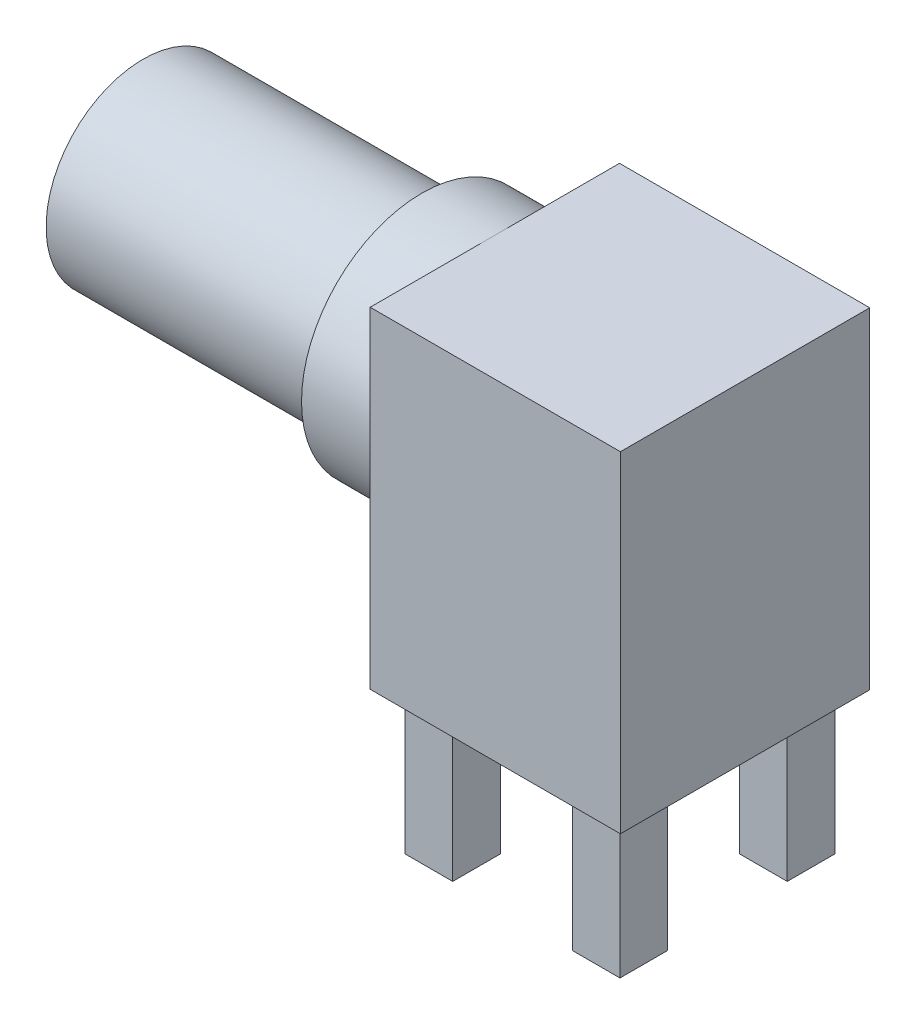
ISO-10303-21;
HEADER;
FILE_DESCRIPTION(('STEP AP214'),'2;1');
FILE_NAME('part.step','',(''),(''),'','','');
FILE_SCHEMA(('AUTOMOTIVE_DESIGN { 1 0 10303 214 1 1 1 1 }'));
ENDSEC;
DATA;
#1=APPLICATION_CONTEXT('core data for automotive mechanical design processes');
#2=APPLICATION_PROTOCOL_DEFINITION('international standard','automotive_design',2000,#1);
#3=PRODUCT_CONTEXT('',#1,'mechanical');
#4=PRODUCT('Part','Part','',(#3));
#5=PRODUCT_RELATED_PRODUCT_CATEGORY('part','',(#4));
#6=PRODUCT_DEFINITION_FORMATION('','',#4);
#7=PRODUCT_DEFINITION_CONTEXT('part definition',#1,'design');
#8=PRODUCT_DEFINITION('design','',#6,#7);
#9=PRODUCT_DEFINITION_SHAPE('','',#8);
#10=(LENGTH_UNIT() NAMED_UNIT(*) SI_UNIT(.MILLI.,.METRE.));
#11=(NAMED_UNIT(*) PLANE_ANGLE_UNIT() SI_UNIT($,.RADIAN.));
#12=(NAMED_UNIT(*) SI_UNIT($,.STERADIAN.) SOLID_ANGLE_UNIT());
#13=UNCERTAINTY_MEASURE_WITH_UNIT(LENGTH_MEASURE(1.E-05),#10,'distance_accuracy_value','');
#14=(GEOMETRIC_REPRESENTATION_CONTEXT(3) GLOBAL_UNCERTAINTY_ASSIGNED_CONTEXT((#13)) GLOBAL_UNIT_ASSIGNED_CONTEXT((#10,
#11,#12)) REPRESENTATION_CONTEXT('',''));
#15=CARTESIAN_POINT('',(0.,0.,0.));
#16=DIRECTION('',(0.,0.,1.));
#17=DIRECTION('',(1.,0.,0.));
#18=AXIS2_PLACEMENT_3D('',#15,#16,#17);
#19=CARTESIAN_POINT('',(-3.50519999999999,-4.63549999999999,3.4925));
#20=DIRECTION('',(0.,1.,0.));
#21=DIRECTION('',(0.,0.,1.));
#22=AXIS2_PLACEMENT_3D('',#19,#20,#21);
#23=PLANE('',#22);
#24=CARTESIAN_POINT('',(0.,-4.63549999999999,0.));
#25=DIRECTION('',(0.,-1.,0.));
#26=DIRECTION('',(0.,0.,-1.));
#27=AXIS2_PLACEMENT_3D('',#24,#25,#26);
#28=CIRCLE('',#27,1.27);
#29=CARTESIAN_POINT('',(0.,-4.63549999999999,-1.27));
#30=VERTEX_POINT('',#29);
#31=EDGE_CURVE('E735',#30,#30,#28,.T.);
#32=ORIENTED_EDGE('',*,*,#31,.F.);
#33=EDGE_LOOP('',(#32));
#34=FACE_BOUND('',#33,.T.);
#35=DIRECTION('',(0.,0.,1.));
#36=VECTOR('',#35,1.);
#37=CARTESIAN_POINT('',(3.0099,-4.63549999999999,-1.6764));
#38=LINE('',#37,#36);
#39=CARTESIAN_POINT('',(3.0099,-4.63549999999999,-3.0099));
#40=VERTEX_POINT('',#39);
#41=CARTESIAN_POINT('',(3.0099,-4.63549999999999,-1.6764));
#42=VERTEX_POINT('',#41);
#43=EDGE_CURVE('E196',#40,#42,#38,.T.);
#44=ORIENTED_EDGE('',*,*,#43,.F.);
#45=DIRECTION('',(1.,0.,0.));
#46=VECTOR('',#45,1.);
#47=CARTESIAN_POINT('',(1.6764,-4.63549999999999,-3.0099));
#48=LINE('',#47,#46);
#49=CARTESIAN_POINT('',(1.6764,-4.63549999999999,-3.0099));
#50=VERTEX_POINT('',#49);
#51=EDGE_CURVE('E209',#50,#40,#48,.T.);
#52=ORIENTED_EDGE('',*,*,#51,.F.);
#53=DIRECTION('',(0.,0.,-1.));
#54=VECTOR('',#53,1.);
#55=CARTESIAN_POINT('',(1.6764,-4.63549999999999,-1.6764));
#56=LINE('',#55,#54);
#57=CARTESIAN_POINT('',(1.6764,-4.63549999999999,-1.6764));
#58=VERTEX_POINT('',#57);
#59=EDGE_CURVE('E218',#58,#50,#56,.T.);
#60=ORIENTED_EDGE('',*,*,#59,.F.);
#61=DIRECTION('',(-1.,0.,0.));
#62=VECTOR('',#61,1.);
#63=CARTESIAN_POINT('',(1.6764,-4.63549999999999,-1.6764));
#64=LINE('',#63,#62);
#65=EDGE_CURVE('E199',#42,#58,#64,.T.);
#66=ORIENTED_EDGE('',*,*,#65,.F.);
#67=EDGE_LOOP('',(#44,#52,#60,#66));
#68=FACE_BOUND('',#67,.T.);
#69=DIRECTION('',(0.,0.,-1.));
#70=VECTOR('',#69,1.);
#71=CARTESIAN_POINT('',(1.6764,-4.63549999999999,1.6764));
#72=LINE('',#71,#70);
#73=CARTESIAN_POINT('',(1.6764,-4.63549999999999,3.0099));
#74=VERTEX_POINT('',#73);
#75=CARTESIAN_POINT('',(1.6764,-4.63549999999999,1.6764));
#76=VERTEX_POINT('',#75);
#77=EDGE_CURVE('E237',#74,#76,#72,.T.);
#78=ORIENTED_EDGE('',*,*,#77,.F.);
#79=DIRECTION('',(-1.,0.,0.));
#80=VECTOR('',#79,1.);
#81=CARTESIAN_POINT('',(3.0099,-4.63549999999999,3.0099));
#82=LINE('',#81,#80);
#83=CARTESIAN_POINT('',(3.0099,-4.63549999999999,3.0099));
#84=VERTEX_POINT('',#83);
#85=EDGE_CURVE('E242',#84,#74,#82,.T.);
#86=ORIENTED_EDGE('',*,*,#85,.F.);
#87=DIRECTION('',(0.,0.,1.));
#88=VECTOR('',#87,1.);
#89=CARTESIAN_POINT('',(3.0099,-4.63549999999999,1.6764));
#90=LINE('',#89,#88);
#91=CARTESIAN_POINT('',(3.0099,-4.63549999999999,1.6764));
#92=VERTEX_POINT('',#91);
#93=EDGE_CURVE('E254',#92,#84,#90,.T.);
#94=ORIENTED_EDGE('',*,*,#93,.F.);
#95=DIRECTION('',(1.,0.,0.));
#96=VECTOR('',#95,1.);
#97=CARTESIAN_POINT('',(3.0099,-4.63549999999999,1.6764));
#98=LINE('',#97,#96);
#99=EDGE_CURVE('E251',#76,#92,#98,.T.);
#100=ORIENTED_EDGE('',*,*,#99,.F.);
#101=EDGE_LOOP('',(#78,#86,#94,#100));
#102=FACE_BOUND('',#101,.T.);
#103=DIRECTION('',(1.,0.,0.));
#104=VECTOR('',#103,1.);
#105=CARTESIAN_POINT('',(-3.50519999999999,-4.63549999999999,-3.4925));
#106=LINE('',#105,#104);
#107=CARTESIAN_POINT('',(-3.50519999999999,-4.63549999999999,-3.4925));
#108=VERTEX_POINT('',#107);
#109=CARTESIAN_POINT('',(3.50520000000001,-4.63549999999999,-3.4925));
#110=VERTEX_POINT('',#109);
#111=EDGE_CURVE('E332',#108,#110,#106,.T.);
#112=ORIENTED_EDGE('',*,*,#111,.T.);
#113=DIRECTION('',(0.,0.,-1.));
#114=VECTOR('',#113,1.);
#115=CARTESIAN_POINT('',(3.50520000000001,-4.63549999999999,3.4925));
#116=LINE('',#115,#114);
#117=CARTESIAN_POINT('',(3.50520000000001,-4.63549999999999,3.4925));
#118=VERTEX_POINT('',#117);
#119=EDGE_CURVE('E338',#118,#110,#116,.T.);
#120=ORIENTED_EDGE('',*,*,#119,.F.);
#121=DIRECTION('',(1.,0.,0.));
#122=VECTOR('',#121,1.);
#123=CARTESIAN_POINT('',(-3.50519999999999,-4.63549999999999,3.4925));
#124=LINE('',#123,#122);
#125=CARTESIAN_POINT('',(-3.50519999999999,-4.63549999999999,3.4925));
#126=VERTEX_POINT('',#125);
#127=EDGE_CURVE('E336',#126,#118,#124,.T.);
#128=ORIENTED_EDGE('',*,*,#127,.F.);
#129=DIRECTION('',(0.,0.,-1.));
#130=VECTOR('',#129,1.);
#131=CARTESIAN_POINT('',(-3.50519999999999,-4.63549999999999,3.4925));
#132=LINE('',#131,#130);
#133=EDGE_CURVE('E349',#126,#108,#132,.T.);
#134=ORIENTED_EDGE('',*,*,#133,.T.);
#135=EDGE_LOOP('',(#112,#120,#128,#134));
#136=FACE_BOUND('',#135,.T.);
#137=DIRECTION('',(0.,0.,1.));
#138=VECTOR('',#137,1.);
#139=CARTESIAN_POINT('',(-1.6764,-4.63549999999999,1.6764));
#140=LINE('',#139,#138);
#141=CARTESIAN_POINT('',(-1.6764,-4.63549999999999,1.6764));
#142=VERTEX_POINT('',#141);
#143=CARTESIAN_POINT('',(-1.6764,-4.63549999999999,3.0099));
#144=VERTEX_POINT('',#143);
#145=EDGE_CURVE('E270',#142,#144,#140,.T.);
#146=ORIENTED_EDGE('',*,*,#145,.F.);
#147=DIRECTION('',(1.,0.,0.));
#148=VECTOR('',#147,1.);
#149=CARTESIAN_POINT('',(-3.0099,-4.63549999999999,1.6764));
#150=LINE('',#149,#148);
#151=CARTESIAN_POINT('',(-3.0099,-4.63549999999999,1.6764));
#152=VERTEX_POINT('',#151);
#153=EDGE_CURVE('E275',#152,#142,#150,.T.);
#154=ORIENTED_EDGE('',*,*,#153,.F.);
#155=DIRECTION('',(0.,0.,-1.));
#156=VECTOR('',#155,1.);
#157=CARTESIAN_POINT('',(-3.0099,-4.63549999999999,1.6764));
#158=LINE('',#157,#156);
#159=CARTESIAN_POINT('',(-3.0099,-4.63549999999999,3.0099));
#160=VERTEX_POINT('',#159);
#161=EDGE_CURVE('E287',#160,#152,#158,.T.);
#162=ORIENTED_EDGE('',*,*,#161,.F.);
#163=DIRECTION('',(-1.,0.,0.));
#164=VECTOR('',#163,1.);
#165=CARTESIAN_POINT('',(-3.0099,-4.63549999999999,3.0099));
#166=LINE('',#165,#164);
#167=EDGE_CURVE('E284',#144,#160,#166,.T.);
#168=ORIENTED_EDGE('',*,*,#167,.F.);
#169=EDGE_LOOP('',(#146,#154,#162,#168));
#170=FACE_BOUND('',#169,.T.);
#171=DIRECTION('',(0.,0.,1.));
#172=VECTOR('',#171,1.);
#173=CARTESIAN_POINT('',(-1.6764,-4.63549999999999,-1.6764));
#174=LINE('',#173,#172);
#175=CARTESIAN_POINT('',(-1.6764,-4.63549999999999,-3.0099));
#176=VERTEX_POINT('',#175);
#177=CARTESIAN_POINT('',(-1.6764,-4.63549999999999,-1.6764));
#178=VERTEX_POINT('',#177);
#179=EDGE_CURVE('E195',#176,#178,#174,.T.);
#180=ORIENTED_EDGE('',*,*,#179,.F.);
#181=DIRECTION('',(1.,0.,0.));
#182=VECTOR('',#181,1.);
#183=CARTESIAN_POINT('',(-3.0099,-4.63549999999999,-3.0099));
#184=LINE('',#183,#182);
#185=CARTESIAN_POINT('',(-3.0099,-4.63549999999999,-3.0099));
#186=VERTEX_POINT('',#185);
#187=EDGE_CURVE('E192',#186,#176,#184,.T.);
#188=ORIENTED_EDGE('',*,*,#187,.F.);
#189=DIRECTION('',(0.,0.,-1.));
#190=VECTOR('',#189,1.);
#191=CARTESIAN_POINT('',(-3.0099,-4.63549999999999,-1.6764));
#192=LINE('',#191,#190);
#193=CARTESIAN_POINT('',(-3.0099,-4.63549999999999,-1.6764));
#194=VERTEX_POINT('',#193);
#195=EDGE_CURVE('E55',#194,#186,#192,.T.);
#196=ORIENTED_EDGE('',*,*,#195,.F.);
#197=DIRECTION('',(-1.,0.,0.));
#198=VECTOR('',#197,1.);
#199=CARTESIAN_POINT('',(-3.0099,-4.63549999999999,-1.6764));
#200=LINE('',#199,#198);
#201=EDGE_CURVE('E50',#178,#194,#200,.T.);
#202=ORIENTED_EDGE('',*,*,#201,.F.);
#203=EDGE_LOOP('',(#180,#188,#196,#202));
#204=FACE_BOUND('',#203,.T.);
#205=ADVANCED_FACE('F35',(#34,#68,#102,#136,#170,#204),#23,.F.);
#206=CARTESIAN_POINT('',(-5.54989999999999,1.26365000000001,0.));
#207=DIRECTION('',(-1.,0.,0.));
#208=DIRECTION('',(0.,0.,1.));
#209=AXIS2_PLACEMENT_3D('',#206,#207,#208);
#210=PLANE('',#209);
#211=CARTESIAN_POINT('',(-5.54989999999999,1.26365000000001,0.));
#212=DIRECTION('',(-1.,0.,0.));
#213=DIRECTION('',(0.,0.,1.));
#214=AXIS2_PLACEMENT_3D('',#211,#212,#213);
#215=CIRCLE('',#214,3.37185);
#216=CARTESIAN_POINT('',(-5.54989999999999,1.26365000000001,3.37185));
#217=VERTEX_POINT('',#216);
#218=EDGE_CURVE('E322',#217,#217,#215,.T.);
#219=ORIENTED_EDGE('',*,*,#218,.T.);
#220=EDGE_LOOP('',(#219));
#221=FACE_BOUND('',#220,.T.);
#222=CARTESIAN_POINT('',(-5.54989999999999,1.26365000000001,0.));
#223=DIRECTION('',(-1.,0.,0.));
#224=DIRECTION('',(0.,0.,1.));
#225=AXIS2_PLACEMENT_3D('',#222,#223,#224);
#226=CIRCLE('',#225,2.7178);
#227=CARTESIAN_POINT('',(-5.54989999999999,1.26365000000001,-2.7178));
#228=VERTEX_POINT('',#227);
#229=EDGE_CURVE('E313',#228,#228,#226,.T.);
#230=ORIENTED_EDGE('',*,*,#229,.F.);
#231=EDGE_LOOP('',(#230));
#232=FACE_BOUND('',#231,.T.);
#233=ADVANCED_FACE('F385',(#221,#232),#210,.T.);
#234=CARTESIAN_POINT('',(-3.50519999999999,-4.63549999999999,3.4925));
#235=DIRECTION('',(1.,0.,0.));
#236=DIRECTION('',(0.,0.,-1.));
#237=AXIS2_PLACEMENT_3D('',#234,#235,#236);
#238=PLANE('',#237);
#239=DIRECTION('',(0.,0.,-1.));
#240=VECTOR('',#239,1.);
#241=CARTESIAN_POINT('',(-3.50519999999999,4.63550000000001,3.4925));
#242=LINE('',#241,#240);
#243=CARTESIAN_POINT('',(-3.50519999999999,4.63550000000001,3.4925));
#244=VERTEX_POINT('',#243);
#245=CARTESIAN_POINT('',(-3.50519999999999,4.63550000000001,0.));
#246=VERTEX_POINT('',#245);
#247=EDGE_CURVE('E43',#244,#246,#242,.T.);
#248=ORIENTED_EDGE('',*,*,#247,.T.);
#249=CARTESIAN_POINT('',(-3.50519999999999,1.26365000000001,0.));
#250=DIRECTION('',(-1.,0.,0.));
#251=DIRECTION('',(0.,0.,1.));
#252=AXIS2_PLACEMENT_3D('',#249,#250,#251);
#253=CIRCLE('',#252,3.37185);
#254=EDGE_CURVE('E319',#246,#246,#253,.T.);
#255=ORIENTED_EDGE('',*,*,#254,.F.);
#256=CARTESIAN_POINT('',(-3.50519999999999,4.63550000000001,-3.4925));
#257=VERTEX_POINT('',#256);
#258=EDGE_CURVE('E351',#246,#257,#242,.T.);
#259=ORIENTED_EDGE('',*,*,#258,.T.);
#260=DIRECTION('',(0.,-1.,0.));
#261=VECTOR('',#260,1.);
#262=CARTESIAN_POINT('',(-3.50519999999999,-4.63549999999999,-3.4925));
#263=LINE('',#262,#261);
#264=EDGE_CURVE('E344',#257,#108,#263,.T.);
#265=ORIENTED_EDGE('',*,*,#264,.T.);
#266=ORIENTED_EDGE('',*,*,#133,.F.);
#267=DIRECTION('',(0.,-1.,0.));
#268=VECTOR('',#267,1.);
#269=CARTESIAN_POINT('',(-3.50519999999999,-4.63549999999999,3.4925));
#270=LINE('',#269,#268);
#271=EDGE_CURVE('E334',#244,#126,#270,.T.);
#272=ORIENTED_EDGE('',*,*,#271,.F.);
#273=EDGE_LOOP('',(#248,#255,#259,#265,#266,#272));
#274=FACE_BOUND('',#273,.T.);
#275=ADVANCED_FACE('F357',(#274),#238,.F.);
#276=CARTESIAN_POINT('',(3.50520000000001,-4.63549999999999,3.4925));
#277=DIRECTION('',(-1.,0.,0.));
#278=DIRECTION('',(0.,0.,1.));
#279=AXIS2_PLACEMENT_3D('',#276,#277,#278);
#280=PLANE('',#279);
#281=DIRECTION('',(0.,1.,0.));
#282=VECTOR('',#281,1.);
#283=CARTESIAN_POINT('',(3.50520000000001,-4.63549999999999,-3.4925));
#284=LINE('',#283,#282);
#285=CARTESIAN_POINT('',(3.50520000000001,4.63550000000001,-3.4925));
#286=VERTEX_POINT('',#285);
#287=EDGE_CURVE('E325',#110,#286,#284,.T.);
#288=ORIENTED_EDGE('',*,*,#287,.T.);
#289=DIRECTION('',(0.,0.,-1.));
#290=VECTOR('',#289,1.);
#291=CARTESIAN_POINT('',(3.50520000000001,4.63550000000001,3.4925));
#292=LINE('',#291,#290);
#293=CARTESIAN_POINT('',(3.50520000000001,4.63550000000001,3.4925));
#294=VERTEX_POINT('',#293);
#295=EDGE_CURVE('E11',#294,#286,#292,.T.);
#296=ORIENTED_EDGE('',*,*,#295,.F.);
#297=DIRECTION('',(0.,1.,0.));
#298=VECTOR('',#297,1.);
#299=CARTESIAN_POINT('',(3.50520000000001,-4.63549999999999,3.4925));
#300=LINE('',#299,#298);
#301=EDGE_CURVE('E328',#118,#294,#300,.T.);
#302=ORIENTED_EDGE('',*,*,#301,.F.);
#303=ORIENTED_EDGE('',*,*,#119,.T.);
#304=EDGE_LOOP('',(#288,#296,#302,#303));
#305=FACE_BOUND('',#304,.T.);
#306=ADVANCED_FACE('F37',(#305),#280,.F.);
#307=CARTESIAN_POINT('',(-3.50519999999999,4.63550000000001,3.4925));
#308=DIRECTION('',(0.,-1.,0.));
#309=DIRECTION('',(0.,0.,-1.));
#310=AXIS2_PLACEMENT_3D('',#307,#308,#309);
#311=PLANE('',#310);
#312=DIRECTION('',(-1.,0.,0.));
#313=VECTOR('',#312,1.);
#314=CARTESIAN_POINT('',(-3.50519999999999,4.63550000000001,-3.4925));
#315=LINE('',#314,#313);
#316=EDGE_CURVE('E341',#286,#257,#315,.T.);
#317=ORIENTED_EDGE('',*,*,#316,.T.);
#318=ORIENTED_EDGE('',*,*,#258,.F.);
#319=ORIENTED_EDGE('',*,*,#247,.F.);
#320=DIRECTION('',(-1.,0.,0.));
#321=VECTOR('',#320,1.);
#322=CARTESIAN_POINT('',(-3.50519999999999,4.63550000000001,3.4925));
#323=LINE('',#322,#321);
#324=EDGE_CURVE('E331',#294,#244,#323,.T.);
#325=ORIENTED_EDGE('',*,*,#324,.F.);
#326=ORIENTED_EDGE('',*,*,#295,.T.);
#327=EDGE_LOOP('',(#317,#318,#319,#325,#326));
#328=FACE_BOUND('',#327,.T.);
#329=ADVANCED_FACE('F361',(#328),#311,.F.);
#330=CARTESIAN_POINT('',(0.,0.,3.4925));
#331=DIRECTION('',(0.,0.,-1.));
#332=DIRECTION('',(-1.,0.,0.));
#333=AXIS2_PLACEMENT_3D('',#330,#331,#332);
#334=PLANE('',#333);
#335=ORIENTED_EDGE('',*,*,#301,.T.);
#336=ORIENTED_EDGE('',*,*,#324,.T.);
#337=ORIENTED_EDGE('',*,*,#271,.T.);
#338=ORIENTED_EDGE('',*,*,#127,.T.);
#339=EDGE_LOOP('',(#335,#336,#337,#338));
#340=FACE_BOUND('',#339,.T.);
#341=ADVANCED_FACE('F374',(#340),#334,.F.);
#342=CARTESIAN_POINT('',(0.,0.,-3.4925));
#343=DIRECTION('',(0.,0.,-1.));
#344=DIRECTION('',(-1.,0.,0.));
#345=AXIS2_PLACEMENT_3D('',#342,#343,#344);
#346=PLANE('',#345);
#347=ORIENTED_EDGE('',*,*,#287,.F.);
#348=ORIENTED_EDGE('',*,*,#111,.F.);
#349=ORIENTED_EDGE('',*,*,#264,.F.);
#350=ORIENTED_EDGE('',*,*,#316,.F.);
#351=EDGE_LOOP('',(#347,#348,#349,#350));
#352=FACE_BOUND('',#351,.T.);
#353=ADVANCED_FACE('F366',(#352),#346,.T.);
#354=CARTESIAN_POINT('',(-5.54989999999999,1.26365000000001,0.));
#355=DIRECTION('',(1.,0.,0.));
#356=DIRECTION('',(0.,0.,-1.));
#357=AXIS2_PLACEMENT_3D('',#354,#355,#356);
#358=CYLINDRICAL_SURFACE('',#357,3.37185);
#359=ORIENTED_EDGE('',*,*,#218,.F.);
#360=EDGE_LOOP('',(#359));
#361=FACE_BOUND('',#360,.T.);
#362=ORIENTED_EDGE('',*,*,#254,.T.);
#363=EDGE_LOOP('',(#362));
#364=FACE_BOUND('',#363,.T.);
#365=ADVANCED_FACE('F381',(#361,#364),#358,.T.);
#366=CARTESIAN_POINT('',(-13.3604,1.26365000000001,0.));
#367=DIRECTION('',(1.,0.,0.));
#368=DIRECTION('',(0.,0.,-1.));
#369=AXIS2_PLACEMENT_3D('',#366,#367,#368);
#370=CYLINDRICAL_SURFACE('',#369,2.7178);
#371=CARTESIAN_POINT('',(-13.3604,1.26365000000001,0.));
#372=DIRECTION('',(-1.,0.,0.));
#373=DIRECTION('',(0.,0.,1.));
#374=AXIS2_PLACEMENT_3D('',#371,#372,#373);
#375=CIRCLE('',#374,2.7178);
#376=CARTESIAN_POINT('',(-13.3604,1.26365000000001,-2.7178));
#377=VERTEX_POINT('',#376);
#378=EDGE_CURVE('E316',#377,#377,#375,.T.);
#379=CARTESIAN_POINT('',(-13.3604,1.26365000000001,-2.7178));
#380=CARTESIAN_POINT('',(-13.279040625,1.26365000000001,-2.7178));
#381=CARTESIAN_POINT('',(-13.19768125,1.26365000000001,-2.7178));
#382=CARTESIAN_POINT('',(-13.0349625,1.26365000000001,-2.7178));
#383=CARTESIAN_POINT('',(-12.953603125,1.26365000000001,-2.7178));
#384=CARTESIAN_POINT('',(-12.790884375,1.26365000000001,-2.7178));
#385=CARTESIAN_POINT('',(-12.709525,1.26365000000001,-2.7178));
#386=CARTESIAN_POINT('',(-12.54680625,1.26365000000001,-2.7178));
#387=CARTESIAN_POINT('',(-12.465446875,1.26365000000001,-2.7178));
#388=CARTESIAN_POINT('',(-12.302728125,1.26365000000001,-2.7178));
#389=CARTESIAN_POINT('',(-12.22136875,1.26365000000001,-2.7178));
#390=CARTESIAN_POINT('',(-12.05865,1.26365000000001,-2.7178));
#391=CARTESIAN_POINT('',(-11.977290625,1.26365000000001,-2.7178));
#392=CARTESIAN_POINT('',(-11.814571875,1.26365000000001,-2.7178));
#393=CARTESIAN_POINT('',(-11.7332125,1.26365000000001,-2.7178));
#394=CARTESIAN_POINT('',(-11.57049375,1.26365000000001,-2.7178));
#395=CARTESIAN_POINT('',(-11.489134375,1.26365000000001,-2.7178));
#396=CARTESIAN_POINT('',(-11.326415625,1.26365000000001,-2.7178));
#397=CARTESIAN_POINT('',(-11.24505625,1.26365000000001,-2.7178));
#398=CARTESIAN_POINT('',(-11.0823375,1.26365000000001,-2.7178));
#399=CARTESIAN_POINT('',(-11.000978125,1.26365000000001,-2.7178));
#400=CARTESIAN_POINT('',(-10.838259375,1.26365000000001,-2.7178));
#401=CARTESIAN_POINT('',(-10.7569,1.26365000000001,-2.7178));
#402=CARTESIAN_POINT('',(-10.59418125,1.26365000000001,-2.7178));
#403=CARTESIAN_POINT('',(-10.512821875,1.26365000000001,-2.7178));
#404=CARTESIAN_POINT('',(-10.350103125,1.26365000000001,-2.7178));
#405=CARTESIAN_POINT('',(-10.26874375,1.26365000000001,-2.7178));
#406=CARTESIAN_POINT('',(-10.106025,1.26365000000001,-2.7178));
#407=CARTESIAN_POINT('',(-10.024665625,1.26365000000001,-2.7178));
#408=CARTESIAN_POINT('',(-9.86194687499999,1.26365000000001,-2.7178));
#409=CARTESIAN_POINT('',(-9.78058749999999,1.26365000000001,-2.7178));
#410=CARTESIAN_POINT('',(-9.61786874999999,1.26365000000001,-2.7178));
#411=CARTESIAN_POINT('',(-9.53650937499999,1.26365000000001,-2.7178));
#412=CARTESIAN_POINT('',(-9.37379062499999,1.26365000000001,-2.7178));
#413=CARTESIAN_POINT('',(-9.29243124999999,1.26365000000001,-2.7178));
#414=CARTESIAN_POINT('',(-9.12971249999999,1.26365000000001,-2.7178));
#415=CARTESIAN_POINT('',(-9.04835312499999,1.26365000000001,-2.7178));
#416=CARTESIAN_POINT('',(-8.885634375,1.26365000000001,-2.7178));
#417=CARTESIAN_POINT('',(-8.80427499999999,1.26365000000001,-2.7178));
#418=CARTESIAN_POINT('',(-8.64155625,1.26365000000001,-2.7178));
#419=CARTESIAN_POINT('',(-8.56019687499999,1.26365000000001,-2.7178));
#420=CARTESIAN_POINT('',(-8.39747812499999,1.26365000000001,-2.7178));
#421=CARTESIAN_POINT('',(-8.31611874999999,1.26365000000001,-2.7178));
#422=CARTESIAN_POINT('',(-8.15339999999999,1.26365000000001,-2.7178));
#423=CARTESIAN_POINT('',(-8.07204062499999,1.26365000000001,-2.7178));
#424=CARTESIAN_POINT('',(-7.90932187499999,1.26365000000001,-2.7178));
#425=CARTESIAN_POINT('',(-7.82796249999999,1.26365000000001,-2.7178));
#426=CARTESIAN_POINT('',(-7.66524374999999,1.26365000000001,-2.7178));
#427=CARTESIAN_POINT('',(-7.58388437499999,1.26365000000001,-2.7178));
#428=CARTESIAN_POINT('',(-7.42116562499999,1.26365000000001,-2.7178));
#429=CARTESIAN_POINT('',(-7.33980624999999,1.26365000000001,-2.7178));
#430=CARTESIAN_POINT('',(-7.17708749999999,1.26365000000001,-2.7178));
#431=CARTESIAN_POINT('',(-7.09572812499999,1.26365000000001,-2.7178));
#432=CARTESIAN_POINT('',(-6.93300937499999,1.26365000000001,-2.7178));
#433=CARTESIAN_POINT('',(-6.85164999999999,1.26365000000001,-2.7178));
#434=CARTESIAN_POINT('',(-6.68893124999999,1.26365000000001,-2.7178));
#435=CARTESIAN_POINT('',(-6.60757187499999,1.26365000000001,-2.7178));
#436=CARTESIAN_POINT('',(-6.44485312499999,1.26365000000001,-2.7178));
#437=CARTESIAN_POINT('',(-6.36349374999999,1.26365000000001,-2.7178));
#438=CARTESIAN_POINT('',(-6.20077499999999,1.26365000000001,-2.7178));
#439=CARTESIAN_POINT('',(-6.11941562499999,1.26365000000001,-2.7178));
#440=CARTESIAN_POINT('',(-5.95669687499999,1.26365000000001,-2.7178));
#441=CARTESIAN_POINT('',(-5.87533749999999,1.26365000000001,-2.7178));
#442=CARTESIAN_POINT('',(-5.71261874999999,1.26365000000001,-2.7178));
#443=CARTESIAN_POINT('',(-5.63125937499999,1.26365000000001,-2.7178));
#444=CARTESIAN_POINT('',(-5.54989999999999,1.26365000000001,-2.7178));
#445=B_SPLINE_CURVE_WITH_KNOTS('',3,(#379,#380,#381,#382,#383,#384,#385,#386,#387,#388,#389,
#390,#391,#392,#393,#394,#395,#396,#397,#398,#399,#400,#401,#402,#403,#404,#405,#406,#407,#408,
#409,#410,#411,#412,#413,#414,#415,#416,#417,#418,#419,#420,#421,#422,#423,#424,#425,#426,#427,
#428,#429,#430,#431,#432,#433,#434,#435,#436,#437,#438,#439,#440,#441,#442,#443,#444),
.UNSPECIFIED.,.F.,.F.,(4,2,2,2,2,2,2,2,2,2,2,2,2,2,2,2,2,2,2,2,2,2,2,2,2,2,2,2,2,2,2,2,4),(0.,
0.244078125,0.48815625,0.732234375,0.9763125,1.220390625,1.46446875,1.708546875,1.952625,
2.196703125,2.44078125,2.684859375,2.9289375,3.173015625,3.41709375,3.661171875,3.90525,
4.149328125,4.39340625,4.637484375,4.8815625,5.125640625,5.36971875,5.613796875,5.857875,
6.101953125,6.34603125,6.590109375,6.8341875,7.078265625,7.32234375,7.566421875,7.8105),.UNSPECIFIED.);
#446=EDGE_CURVE('BSEAM419',#377,#228,#445,.T.);
#447=ORIENTED_EDGE('',*,*,#378,.F.);
#448=ORIENTED_EDGE('',*,*,#229,.T.);
#449=ORIENTED_EDGE('',*,*,#446,.T.);
#450=ORIENTED_EDGE('',*,*,#446,.F.);
#451=EDGE_LOOP('',(#447,#449,#448,#450));
#452=FACE_BOUND('',#451,.T.);
#453=ADVANCED_FACE('F419',(#452),#370,.T.);
#454=CARTESIAN_POINT('',(-13.3604,1.26365000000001,0.));
#455=DIRECTION('',(-1.,0.,0.));
#456=DIRECTION('',(0.,0.,1.));
#457=AXIS2_PLACEMENT_3D('',#454,#455,#456);
#458=PLANE('',#457);
#459=CARTESIAN_POINT('',(-13.3604,1.26365000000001,0.));
#460=DIRECTION('',(-1.,0.,0.));
#461=DIRECTION('',(0.,0.,1.));
#462=AXIS2_PLACEMENT_3D('',#459,#460,#461);
#463=CIRCLE('',#462,2.19252833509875);
#464=CARTESIAN_POINT('',(-13.3604,1.26365000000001,2.19252833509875));
#465=VERTEX_POINT('',#464);
#466=EDGE_CURVE('E307',#465,#465,#463,.T.);
#467=ORIENTED_EDGE('',*,*,#466,.F.);
#468=EDGE_LOOP('',(#467));
#469=FACE_BOUND('',#468,.T.);
#470=ORIENTED_EDGE('',*,*,#378,.T.);
#471=EDGE_LOOP('',(#470));
#472=FACE_BOUND('',#471,.T.);
#473=ADVANCED_FACE('F434',(#469,#472),#458,.T.);
#474=CARTESIAN_POINT('',(-10.1854,1.26365000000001,0.));
#475=DIRECTION('',(-1.,0.,0.));
#476=DIRECTION('',(0.,0.,1.));
#477=AXIS2_PLACEMENT_3D('',#474,#475,#476);
#478=CYLINDRICAL_SURFACE('',#477,2.19252833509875);
#479=CARTESIAN_POINT('',(-10.1854,1.26365000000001,0.));
#480=DIRECTION('',(-1.,0.,0.));
#481=DIRECTION('',(0.,0.,1.));
#482=AXIS2_PLACEMENT_3D('',#479,#480,#481);
#483=CIRCLE('',#482,2.19252833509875);
#484=CARTESIAN_POINT('',(-10.1854,1.26365000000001,2.19252833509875));
#485=VERTEX_POINT('',#484);
#486=EDGE_CURVE('E310',#485,#485,#483,.T.);
#487=ORIENTED_EDGE('',*,*,#486,.F.);
#488=EDGE_LOOP('',(#487));
#489=FACE_BOUND('',#488,.T.);
#490=ORIENTED_EDGE('',*,*,#466,.T.);
#491=EDGE_LOOP('',(#490));
#492=FACE_BOUND('',#491,.T.);
#493=ADVANCED_FACE('F444',(#489,#492),#478,.F.);
#494=CARTESIAN_POINT('',(-10.1854,1.26365000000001,0.));
#495=DIRECTION('',(-1.,0.,0.));
#496=DIRECTION('',(0.,0.,1.));
#497=AXIS2_PLACEMENT_3D('',#494,#495,#496);
#498=PLANE('',#497);
#499=CARTESIAN_POINT('',(-10.1854,1.26365000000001,0.));
#500=DIRECTION('',(-1.,0.,0.));
#501=DIRECTION('',(0.,0.,1.));
#502=AXIS2_PLACEMENT_3D('',#499,#500,#501);
#503=CIRCLE('',#502,0.636954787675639);
#504=CARTESIAN_POINT('',(-10.1854,1.26365000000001,0.63695478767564));
#505=VERTEX_POINT('',#504);
#506=EDGE_CURVE('E304',#505,#505,#503,.T.);
#507=ORIENTED_EDGE('',*,*,#506,.F.);
#508=EDGE_LOOP('',(#507));
#509=FACE_BOUND('',#508,.T.);
#510=ORIENTED_EDGE('',*,*,#486,.T.);
#511=EDGE_LOOP('',(#510));
#512=FACE_BOUND('',#511,.T.);
#513=ADVANCED_FACE('F456',(#509,#512),#498,.T.);
#514=CARTESIAN_POINT('',(-10.1854,1.26365000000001,0.));
#515=DIRECTION('',(-1.,0.,0.));
#516=DIRECTION('',(0.,0.,1.));
#517=AXIS2_PLACEMENT_3D('',#514,#515,#516);
#518=CYLINDRICAL_SURFACE('',#517,0.636954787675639);
#519=ORIENTED_EDGE('',*,*,#506,.T.);
#520=EDGE_LOOP('',(#519));
#521=FACE_BOUND('',#520,.T.);
#522=CARTESIAN_POINT('',(-13.3604,1.26365000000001,0.));
#523=DIRECTION('',(-1.,0.,0.));
#524=DIRECTION('',(0.,0.,1.));
#525=AXIS2_PLACEMENT_3D('',#522,#523,#524);
#526=CIRCLE('',#525,0.636954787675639);
#527=CARTESIAN_POINT('',(-13.3604,1.26365000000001,0.63695478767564));
#528=VERTEX_POINT('',#527);
#529=EDGE_CURVE('E303',#528,#528,#526,.T.);
#530=ORIENTED_EDGE('',*,*,#529,.F.);
#531=EDGE_LOOP('',(#530));
#532=FACE_BOUND('',#531,.T.);
#533=ADVANCED_FACE('F467',(#521,#532),#518,.T.);
#534=ORIENTED_EDGE('',*,*,#529,.T.);
#535=EDGE_LOOP('',(#534));
#536=FACE_BOUND('',#535,.T.);
#537=ADVANCED_FACE('F447',(#536),#458,.T.);
#538=CARTESIAN_POINT('',(-1.6764,-8.62329999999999,1.6764));
#539=DIRECTION('',(-1.,0.,0.));
#540=DIRECTION('',(0.,0.,1.));
#541=AXIS2_PLACEMENT_3D('',#538,#539,#540);
#542=PLANE('',#541);
#543=ORIENTED_EDGE('',*,*,#145,.T.);
#544=DIRECTION('',(0.,1.,0.));
#545=VECTOR('',#544,1.);
#546=CARTESIAN_POINT('',(-1.6764,-8.62329999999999,3.0099));
#547=LINE('',#546,#545);
#548=CARTESIAN_POINT('',(-1.6764,-8.62329999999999,3.0099));
#549=VERTEX_POINT('',#548);
#550=EDGE_CURVE('E300',#549,#144,#547,.T.);
#551=ORIENTED_EDGE('',*,*,#550,.F.);
#552=DIRECTION('',(0.,0.,1.));
#553=VECTOR('',#552,1.);
#554=CARTESIAN_POINT('',(-1.6764,-8.62329999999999,1.6764));
#555=LINE('',#554,#553);
#556=CARTESIAN_POINT('',(-1.6764,-8.62329999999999,1.6764));
#557=VERTEX_POINT('',#556);
#558=EDGE_CURVE('E271',#557,#549,#555,.T.);
#559=ORIENTED_EDGE('',*,*,#558,.F.);
#560=DIRECTION('',(0.,1.,0.));
#561=VECTOR('',#560,1.);
#562=CARTESIAN_POINT('',(-1.6764,-8.62329999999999,1.6764));
#563=LINE('',#562,#561);
#564=EDGE_CURVE('E281',#557,#142,#563,.T.);
#565=ORIENTED_EDGE('',*,*,#564,.T.);
#566=EDGE_LOOP('',(#543,#551,#559,#565));
#567=FACE_BOUND('',#566,.T.);
#568=ADVANCED_FACE('F487',(#567),#542,.F.);
#569=CARTESIAN_POINT('',(-3.0099,-8.62329999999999,3.0099));
#570=DIRECTION('',(0.,0.,-1.));
#571=DIRECTION('',(-1.,0.,0.));
#572=AXIS2_PLACEMENT_3D('',#569,#570,#571);
#573=PLANE('',#572);
#574=ORIENTED_EDGE('',*,*,#167,.T.);
#575=DIRECTION('',(0.,1.,0.));
#576=VECTOR('',#575,1.);
#577=CARTESIAN_POINT('',(-3.0099,-8.62329999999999,3.0099));
#578=LINE('',#577,#576);
#579=CARTESIAN_POINT('',(-3.0099,-8.62329999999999,3.0099));
#580=VERTEX_POINT('',#579);
#581=EDGE_CURVE('E297',#580,#160,#578,.T.);
#582=ORIENTED_EDGE('',*,*,#581,.F.);
#583=DIRECTION('',(-1.,0.,0.));
#584=VECTOR('',#583,1.);
#585=CARTESIAN_POINT('',(-3.0099,-8.62329999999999,3.0099));
#586=LINE('',#585,#584);
#587=EDGE_CURVE('E274',#549,#580,#586,.T.);
#588=ORIENTED_EDGE('',*,*,#587,.F.);
#589=ORIENTED_EDGE('',*,*,#550,.T.);
#590=EDGE_LOOP('',(#574,#582,#588,#589));
#591=FACE_BOUND('',#590,.T.);
#592=ADVANCED_FACE('F496',(#591),#573,.F.);
#593=CARTESIAN_POINT('',(-3.0099,-8.62329999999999,1.6764));
#594=DIRECTION('',(1.,0.,0.));
#595=DIRECTION('',(0.,0.,-1.));
#596=AXIS2_PLACEMENT_3D('',#593,#594,#595);
#597=PLANE('',#596);
#598=ORIENTED_EDGE('',*,*,#161,.T.);
#599=DIRECTION('',(0.,1.,0.));
#600=VECTOR('',#599,1.);
#601=CARTESIAN_POINT('',(-3.0099,-8.62329999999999,1.6764));
#602=LINE('',#601,#600);
#603=CARTESIAN_POINT('',(-3.0099,-8.62329999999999,1.6764));
#604=VERTEX_POINT('',#603);
#605=EDGE_CURVE('E294',#604,#152,#602,.T.);
#606=ORIENTED_EDGE('',*,*,#605,.F.);
#607=DIRECTION('',(0.,0.,-1.));
#608=VECTOR('',#607,1.);
#609=CARTESIAN_POINT('',(-3.0099,-8.62329999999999,1.6764));
#610=LINE('',#609,#608);
#611=EDGE_CURVE('E277',#580,#604,#610,.T.);
#612=ORIENTED_EDGE('',*,*,#611,.F.);
#613=ORIENTED_EDGE('',*,*,#581,.T.);
#614=EDGE_LOOP('',(#598,#606,#612,#613));
#615=FACE_BOUND('',#614,.T.);
#616=ADVANCED_FACE('F506',(#615),#597,.F.);
#617=CARTESIAN_POINT('',(-3.0099,-8.62329999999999,1.6764));
#618=DIRECTION('',(0.,0.,1.));
#619=DIRECTION('',(1.,0.,0.));
#620=AXIS2_PLACEMENT_3D('',#617,#618,#619);
#621=PLANE('',#620);
#622=ORIENTED_EDGE('',*,*,#153,.T.);
#623=ORIENTED_EDGE('',*,*,#564,.F.);
#624=DIRECTION('',(1.,0.,0.));
#625=VECTOR('',#624,1.);
#626=CARTESIAN_POINT('',(-3.0099,-8.62329999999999,1.6764));
#627=LINE('',#626,#625);
#628=EDGE_CURVE('E279',#604,#557,#627,.T.);
#629=ORIENTED_EDGE('',*,*,#628,.F.);
#630=ORIENTED_EDGE('',*,*,#605,.T.);
#631=EDGE_LOOP('',(#622,#623,#629,#630));
#632=FACE_BOUND('',#631,.T.);
#633=ADVANCED_FACE('F516',(#632),#621,.F.);
#634=CARTESIAN_POINT('',(0.,-8.62329999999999,0.));
#635=DIRECTION('',(0.,1.,0.));
#636=DIRECTION('',(0.,0.,1.));
#637=AXIS2_PLACEMENT_3D('',#634,#635,#636);
#638=PLANE('',#637);
#639=ORIENTED_EDGE('',*,*,#558,.T.);
#640=ORIENTED_EDGE('',*,*,#587,.T.);
#641=ORIENTED_EDGE('',*,*,#611,.T.);
#642=ORIENTED_EDGE('',*,*,#628,.T.);
#643=EDGE_LOOP('',(#639,#640,#641,#642));
#644=FACE_BOUND('',#643,.T.);
#645=ADVANCED_FACE('F526',(#644),#638,.F.);
#646=CARTESIAN_POINT('',(1.6764,-8.62329999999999,1.6764));
#647=DIRECTION('',(1.,0.,0.));
#648=DIRECTION('',(0.,0.,-1.));
#649=AXIS2_PLACEMENT_3D('',#646,#647,#648);
#650=PLANE('',#649);
#651=ORIENTED_EDGE('',*,*,#77,.T.);
#652=DIRECTION('',(0.,1.,0.));
#653=VECTOR('',#652,1.);
#654=CARTESIAN_POINT('',(1.6764,-8.62329999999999,1.6764));
#655=LINE('',#654,#653);
#656=CARTESIAN_POINT('',(1.6764,-8.62329999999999,1.6764));
#657=VERTEX_POINT('',#656);
#658=EDGE_CURVE('E267',#657,#76,#655,.T.);
#659=ORIENTED_EDGE('',*,*,#658,.F.);
#660=DIRECTION('',(0.,0.,-1.));
#661=VECTOR('',#660,1.);
#662=CARTESIAN_POINT('',(1.6764,-8.62329999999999,1.6764));
#663=LINE('',#662,#661);
#664=CARTESIAN_POINT('',(1.6764,-8.62329999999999,3.0099));
#665=VERTEX_POINT('',#664);
#666=EDGE_CURVE('E238',#665,#657,#663,.T.);
#667=ORIENTED_EDGE('',*,*,#666,.F.);
#668=DIRECTION('',(0.,1.,0.));
#669=VECTOR('',#668,1.);
#670=CARTESIAN_POINT('',(1.6764,-8.62329999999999,3.0099));
#671=LINE('',#670,#669);
#672=EDGE_CURVE('E248',#665,#74,#671,.T.);
#673=ORIENTED_EDGE('',*,*,#672,.T.);
#674=EDGE_LOOP('',(#651,#659,#667,#673));
#675=FACE_BOUND('',#674,.T.);
#676=ADVANCED_FACE('F536',(#675),#650,.F.);
#677=CARTESIAN_POINT('',(3.0099,-8.62329999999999,1.6764));
#678=DIRECTION('',(0.,0.,1.));
#679=DIRECTION('',(1.,0.,0.));
#680=AXIS2_PLACEMENT_3D('',#677,#678,#679);
#681=PLANE('',#680);
#682=ORIENTED_EDGE('',*,*,#99,.T.);
#683=DIRECTION('',(0.,1.,0.));
#684=VECTOR('',#683,1.);
#685=CARTESIAN_POINT('',(3.0099,-8.62329999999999,1.6764));
#686=LINE('',#685,#684);
#687=CARTESIAN_POINT('',(3.0099,-8.62329999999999,1.6764));
#688=VERTEX_POINT('',#687);
#689=EDGE_CURVE('E264',#688,#92,#686,.T.);
#690=ORIENTED_EDGE('',*,*,#689,.F.);
#691=DIRECTION('',(1.,0.,0.));
#692=VECTOR('',#691,1.);
#693=CARTESIAN_POINT('',(3.0099,-8.62329999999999,1.6764));
#694=LINE('',#693,#692);
#695=EDGE_CURVE('E241',#657,#688,#694,.T.);
#696=ORIENTED_EDGE('',*,*,#695,.F.);
#697=ORIENTED_EDGE('',*,*,#658,.T.);
#698=EDGE_LOOP('',(#682,#690,#696,#697));
#699=FACE_BOUND('',#698,.T.);
#700=ADVANCED_FACE('F546',(#699),#681,.F.);
#701=CARTESIAN_POINT('',(3.0099,-8.62329999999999,1.6764));
#702=DIRECTION('',(-1.,0.,0.));
#703=DIRECTION('',(0.,0.,1.));
#704=AXIS2_PLACEMENT_3D('',#701,#702,#703);
#705=PLANE('',#704);
#706=ORIENTED_EDGE('',*,*,#93,.T.);
#707=DIRECTION('',(0.,1.,0.));
#708=VECTOR('',#707,1.);
#709=CARTESIAN_POINT('',(3.0099,-8.62329999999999,3.0099));
#710=LINE('',#709,#708);
#711=CARTESIAN_POINT('',(3.0099,-8.62329999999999,3.0099));
#712=VERTEX_POINT('',#711);
#713=EDGE_CURVE('E261',#712,#84,#710,.T.);
#714=ORIENTED_EDGE('',*,*,#713,.F.);
#715=DIRECTION('',(0.,0.,1.));
#716=VECTOR('',#715,1.);
#717=CARTESIAN_POINT('',(3.0099,-8.62329999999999,1.6764));
#718=LINE('',#717,#716);
#719=EDGE_CURVE('E244',#688,#712,#718,.T.);
#720=ORIENTED_EDGE('',*,*,#719,.F.);
#721=ORIENTED_EDGE('',*,*,#689,.T.);
#722=EDGE_LOOP('',(#706,#714,#720,#721));
#723=FACE_BOUND('',#722,.T.);
#724=ADVANCED_FACE('F556',(#723),#705,.F.);
#725=CARTESIAN_POINT('',(3.0099,-8.62329999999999,3.0099));
#726=DIRECTION('',(0.,0.,-1.));
#727=DIRECTION('',(-1.,0.,0.));
#728=AXIS2_PLACEMENT_3D('',#725,#726,#727);
#729=PLANE('',#728);
#730=ORIENTED_EDGE('',*,*,#85,.T.);
#731=ORIENTED_EDGE('',*,*,#672,.F.);
#732=DIRECTION('',(-1.,0.,0.));
#733=VECTOR('',#732,1.);
#734=CARTESIAN_POINT('',(3.0099,-8.62329999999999,3.0099));
#735=LINE('',#734,#733);
#736=EDGE_CURVE('E246',#712,#665,#735,.T.);
#737=ORIENTED_EDGE('',*,*,#736,.F.);
#738=ORIENTED_EDGE('',*,*,#713,.T.);
#739=EDGE_LOOP('',(#730,#731,#737,#738));
#740=FACE_BOUND('',#739,.T.);
#741=ADVANCED_FACE('F566',(#740),#729,.F.);
#742=CARTESIAN_POINT('',(0.,-8.62329999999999,0.));
#743=DIRECTION('',(0.,-1.,0.));
#744=DIRECTION('',(0.,0.,-1.));
#745=AXIS2_PLACEMENT_3D('',#742,#743,#744);
#746=PLANE('',#745);
#747=ORIENTED_EDGE('',*,*,#666,.T.);
#748=ORIENTED_EDGE('',*,*,#695,.T.);
#749=ORIENTED_EDGE('',*,*,#719,.T.);
#750=ORIENTED_EDGE('',*,*,#736,.T.);
#751=EDGE_LOOP('',(#747,#748,#749,#750));
#752=FACE_BOUND('',#751,.T.);
#753=ADVANCED_FACE('F576',(#752),#746,.T.);
#754=CARTESIAN_POINT('',(3.0099,-8.62329999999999,-1.6764));
#755=DIRECTION('',(-1.,0.,0.));
#756=DIRECTION('',(0.,0.,1.));
#757=AXIS2_PLACEMENT_3D('',#754,#755,#756);
#758=PLANE('',#757);
#759=ORIENTED_EDGE('',*,*,#43,.T.);
#760=DIRECTION('',(0.,1.,0.));
#761=VECTOR('',#760,1.);
#762=CARTESIAN_POINT('',(3.0099,-8.62329999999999,-1.6764));
#763=LINE('',#762,#761);
#764=CARTESIAN_POINT('',(3.0099,-8.62329999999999,-1.6764));
#765=VERTEX_POINT('',#764);
#766=EDGE_CURVE('E231',#765,#42,#763,.T.);
#767=ORIENTED_EDGE('',*,*,#766,.F.);
#768=DIRECTION('',(0.,0.,1.));
#769=VECTOR('',#768,1.);
#770=CARTESIAN_POINT('',(3.0099,-8.62329999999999,-1.6764));
#771=LINE('',#770,#769);
#772=CARTESIAN_POINT('',(3.0099,-8.62329999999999,-3.0099));
#773=VERTEX_POINT('',#772);
#774=EDGE_CURVE('E205',#773,#765,#771,.T.);
#775=ORIENTED_EDGE('',*,*,#774,.F.);
#776=DIRECTION('',(0.,1.,0.));
#777=VECTOR('',#776,1.);
#778=CARTESIAN_POINT('',(3.0099,-8.62329999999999,-3.0099));
#779=LINE('',#778,#777);
#780=EDGE_CURVE('E214',#773,#40,#779,.T.);
#781=ORIENTED_EDGE('',*,*,#780,.T.);
#782=EDGE_LOOP('',(#759,#767,#775,#781));
#783=FACE_BOUND('',#782,.T.);
#784=ADVANCED_FACE('F586',(#783),#758,.F.);
#785=CARTESIAN_POINT('',(1.6764,-8.62329999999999,-1.6764));
#786=DIRECTION('',(0.,0.,-1.));
#787=DIRECTION('',(-1.,0.,0.));
#788=AXIS2_PLACEMENT_3D('',#785,#786,#787);
#789=PLANE('',#788);
#790=ORIENTED_EDGE('',*,*,#65,.T.);
#791=DIRECTION('',(0.,1.,0.));
#792=VECTOR('',#791,1.);
#793=CARTESIAN_POINT('',(1.6764,-8.62329999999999,-1.6764));
#794=LINE('',#793,#792);
#795=CARTESIAN_POINT('',(1.6764,-8.62329999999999,-1.6764));
#796=VERTEX_POINT('',#795);
#797=EDGE_CURVE('E228',#796,#58,#794,.T.);
#798=ORIENTED_EDGE('',*,*,#797,.F.);
#799=DIRECTION('',(-1.,0.,0.));
#800=VECTOR('',#799,1.);
#801=CARTESIAN_POINT('',(1.6764,-8.62329999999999,-1.6764));
#802=LINE('',#801,#800);
#803=EDGE_CURVE('E208',#765,#796,#802,.T.);
#804=ORIENTED_EDGE('',*,*,#803,.F.);
#805=ORIENTED_EDGE('',*,*,#766,.T.);
#806=EDGE_LOOP('',(#790,#798,#804,#805));
#807=FACE_BOUND('',#806,.T.);
#808=ADVANCED_FACE('F611',(#807),#789,.F.);
#809=CARTESIAN_POINT('',(1.6764,-8.62329999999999,-1.6764));
#810=DIRECTION('',(1.,0.,0.));
#811=DIRECTION('',(0.,0.,-1.));
#812=AXIS2_PLACEMENT_3D('',#809,#810,#811);
#813=PLANE('',#812);
#814=ORIENTED_EDGE('',*,*,#59,.T.);
#815=DIRECTION('',(0.,1.,0.));
#816=VECTOR('',#815,1.);
#817=CARTESIAN_POINT('',(1.6764,-8.62329999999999,-3.0099));
#818=LINE('',#817,#816);
#819=CARTESIAN_POINT('',(1.6764,-8.62329999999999,-3.0099));
#820=VERTEX_POINT('',#819);
#821=EDGE_CURVE('E225',#820,#50,#818,.T.);
#822=ORIENTED_EDGE('',*,*,#821,.F.);
#823=DIRECTION('',(0.,0.,-1.));
#824=VECTOR('',#823,1.);
#825=CARTESIAN_POINT('',(1.6764,-8.62329999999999,-1.6764));
#826=LINE('',#825,#824);
#827=EDGE_CURVE('E211',#796,#820,#826,.T.);
#828=ORIENTED_EDGE('',*,*,#827,.F.);
#829=ORIENTED_EDGE('',*,*,#797,.T.);
#830=EDGE_LOOP('',(#814,#822,#828,#829));
#831=FACE_BOUND('',#830,.T.);
#832=ADVANCED_FACE('F621',(#831),#813,.F.);
#833=CARTESIAN_POINT('',(1.6764,-8.62329999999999,-3.0099));
#834=DIRECTION('',(0.,0.,1.));
#835=DIRECTION('',(1.,0.,0.));
#836=AXIS2_PLACEMENT_3D('',#833,#834,#835);
#837=PLANE('',#836);
#838=ORIENTED_EDGE('',*,*,#51,.T.);
#839=ORIENTED_EDGE('',*,*,#780,.F.);
#840=DIRECTION('',(1.,0.,0.));
#841=VECTOR('',#840,1.);
#842=CARTESIAN_POINT('',(1.6764,-8.62329999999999,-3.0099));
#843=LINE('',#842,#841);
#844=EDGE_CURVE('E213',#820,#773,#843,.T.);
#845=ORIENTED_EDGE('',*,*,#844,.F.);
#846=ORIENTED_EDGE('',*,*,#821,.T.);
#847=EDGE_LOOP('',(#838,#839,#845,#846));
#848=FACE_BOUND('',#847,.T.);
#849=ADVANCED_FACE('F631',(#848),#837,.F.);
#850=CARTESIAN_POINT('',(0.,-8.62329999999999,0.));
#851=DIRECTION('',(0.,-1.,0.));
#852=DIRECTION('',(0.,0.,-1.));
#853=AXIS2_PLACEMENT_3D('',#850,#851,#852);
#854=PLANE('',#853);
#855=ORIENTED_EDGE('',*,*,#774,.T.);
#856=ORIENTED_EDGE('',*,*,#803,.T.);
#857=ORIENTED_EDGE('',*,*,#827,.T.);
#858=ORIENTED_EDGE('',*,*,#844,.T.);
#859=EDGE_LOOP('',(#855,#856,#857,#858));
#860=FACE_BOUND('',#859,.T.);
#861=ADVANCED_FACE('F641',(#860),#854,.T.);
#862=CARTESIAN_POINT('',(-1.6764,-8.62329999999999,-1.6764));
#863=DIRECTION('',(-1.,0.,0.));
#864=DIRECTION('',(0.,0.,1.));
#865=AXIS2_PLACEMENT_3D('',#862,#863,#864);
#866=PLANE('',#865);
#867=ORIENTED_EDGE('',*,*,#179,.T.);
#868=DIRECTION('',(0.,1.,0.));
#869=VECTOR('',#868,1.);
#870=CARTESIAN_POINT('',(-1.6764,-8.62329999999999,-1.6764));
#871=LINE('',#870,#869);
#872=CARTESIAN_POINT('',(-1.6764,-8.62329999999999,-1.6764));
#873=VERTEX_POINT('',#872);
#874=EDGE_CURVE('E176',#873,#178,#871,.T.);
#875=ORIENTED_EDGE('',*,*,#874,.F.);
#876=DIRECTION('',(0.,0.,1.));
#877=VECTOR('',#876,1.);
#878=CARTESIAN_POINT('',(-1.6764,-8.62329999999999,-1.6764));
#879=LINE('',#878,#877);
#880=CARTESIAN_POINT('',(-1.6764,-8.62329999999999,-3.0099));
#881=VERTEX_POINT('',#880);
#882=EDGE_CURVE('E183',#881,#873,#879,.T.);
#883=ORIENTED_EDGE('',*,*,#882,.F.);
#884=DIRECTION('',(0.,1.,0.));
#885=VECTOR('',#884,1.);
#886=CARTESIAN_POINT('',(-1.6764,-8.62329999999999,-3.0099));
#887=LINE('',#886,#885);
#888=EDGE_CURVE('E745',#881,#176,#887,.T.);
#889=ORIENTED_EDGE('',*,*,#888,.T.);
#890=EDGE_LOOP('',(#867,#875,#883,#889));
#891=FACE_BOUND('',#890,.T.);
#892=ADVANCED_FACE('F194',(#891),#866,.F.);
#893=CARTESIAN_POINT('',(-3.0099,-8.62329999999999,-1.6764));
#894=DIRECTION('',(0.,0.,-1.));
#895=DIRECTION('',(-1.,0.,0.));
#896=AXIS2_PLACEMENT_3D('',#893,#894,#895);
#897=PLANE('',#896);
#898=ORIENTED_EDGE('',*,*,#201,.T.);
#899=DIRECTION('',(0.,1.,0.));
#900=VECTOR('',#899,1.);
#901=CARTESIAN_POINT('',(-3.0099,-8.62329999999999,-1.6764));
#902=LINE('',#901,#900);
#903=CARTESIAN_POINT('',(-3.0099,-8.62329999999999,-1.6764));
#904=VERTEX_POINT('',#903);
#905=EDGE_CURVE('E179',#904,#194,#902,.T.);
#906=ORIENTED_EDGE('',*,*,#905,.F.);
#907=DIRECTION('',(-1.,0.,0.));
#908=VECTOR('',#907,1.);
#909=CARTESIAN_POINT('',(-3.0099,-8.62329999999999,-1.6764));
#910=LINE('',#909,#908);
#911=EDGE_CURVE('E172',#873,#904,#910,.T.);
#912=ORIENTED_EDGE('',*,*,#911,.F.);
#913=ORIENTED_EDGE('',*,*,#874,.T.);
#914=EDGE_LOOP('',(#898,#906,#912,#913));
#915=FACE_BOUND('',#914,.T.);
#916=ADVANCED_FACE('F174',(#915),#897,.F.);
#917=CARTESIAN_POINT('',(-3.0099,-8.62329999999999,-1.6764));
#918=DIRECTION('',(1.,0.,0.));
#919=DIRECTION('',(0.,0.,-1.));
#920=AXIS2_PLACEMENT_3D('',#917,#918,#919);
#921=PLANE('',#920);
#922=ORIENTED_EDGE('',*,*,#195,.T.);
#923=DIRECTION('',(0.,1.,0.));
#924=VECTOR('',#923,1.);
#925=CARTESIAN_POINT('',(-3.0099,-8.62329999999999,-3.0099));
#926=LINE('',#925,#924);
#927=CARTESIAN_POINT('',(-3.0099,-8.62329999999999,-3.0099));
#928=VERTEX_POINT('',#927);
#929=EDGE_CURVE('E201',#928,#186,#926,.T.);
#930=ORIENTED_EDGE('',*,*,#929,.F.);
#931=DIRECTION('',(0.,0.,-1.));
#932=VECTOR('',#931,1.);
#933=CARTESIAN_POINT('',(-3.0099,-8.62329999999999,-1.6764));
#934=LINE('',#933,#932);
#935=EDGE_CURVE('E182',#904,#928,#934,.T.);
#936=ORIENTED_EDGE('',*,*,#935,.F.);
#937=ORIENTED_EDGE('',*,*,#905,.T.);
#938=EDGE_LOOP('',(#922,#930,#936,#937));
#939=FACE_BOUND('',#938,.T.);
#940=ADVANCED_FACE('F668',(#939),#921,.F.);
#941=CARTESIAN_POINT('',(-3.0099,-8.62329999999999,-3.0099));
#942=DIRECTION('',(0.,0.,1.));
#943=DIRECTION('',(1.,0.,0.));
#944=AXIS2_PLACEMENT_3D('',#941,#942,#943);
#945=PLANE('',#944);
#946=ORIENTED_EDGE('',*,*,#187,.T.);
#947=ORIENTED_EDGE('',*,*,#888,.F.);
#948=DIRECTION('',(1.,0.,0.));
#949=VECTOR('',#948,1.);
#950=CARTESIAN_POINT('',(-3.0099,-8.62329999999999,-3.0099));
#951=LINE('',#950,#949);
#952=EDGE_CURVE('E188',#928,#881,#951,.T.);
#953=ORIENTED_EDGE('',*,*,#952,.F.);
#954=ORIENTED_EDGE('',*,*,#929,.T.);
#955=EDGE_LOOP('',(#946,#947,#953,#954));
#956=FACE_BOUND('',#955,.T.);
#957=ADVANCED_FACE('F677',(#956),#945,.F.);
#958=CARTESIAN_POINT('',(0.,-8.62329999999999,0.));
#959=DIRECTION('',(0.,-1.,0.));
#960=DIRECTION('',(0.,0.,-1.));
#961=AXIS2_PLACEMENT_3D('',#958,#959,#960);
#962=PLANE('',#961);
#963=ORIENTED_EDGE('',*,*,#882,.T.);
#964=ORIENTED_EDGE('',*,*,#911,.T.);
#965=ORIENTED_EDGE('',*,*,#935,.T.);
#966=ORIENTED_EDGE('',*,*,#952,.T.);
#967=EDGE_LOOP('',(#963,#964,#965,#966));
#968=FACE_BOUND('',#967,.T.);
#969=ADVANCED_FACE('F186',(#968),#962,.T.);
#970=CARTESIAN_POINT('',(0.,-4.50849999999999,0.));
#971=DIRECTION('',(0.,-1.,0.));
#972=DIRECTION('',(0.,0.,-1.));
#973=AXIS2_PLACEMENT_3D('',#970,#971,#972);
#974=CYLINDRICAL_SURFACE('',#973,1.27);
#975=CARTESIAN_POINT('',(0.,-4.50849999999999,0.));
#976=DIRECTION('',(0.,-1.,0.));
#977=DIRECTION('',(0.,0.,-1.));
#978=AXIS2_PLACEMENT_3D('',#975,#976,#977);
#979=CIRCLE('',#978,1.27);
#980=CARTESIAN_POINT('',(0.,-4.50849999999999,-1.27));
#981=VERTEX_POINT('',#980);
#982=EDGE_CURVE('E738',#981,#981,#979,.T.);
#983=ORIENTED_EDGE('',*,*,#982,.F.);
#984=EDGE_LOOP('',(#983));
#985=FACE_BOUND('',#984,.T.);
#986=ORIENTED_EDGE('',*,*,#31,.T.);
#987=EDGE_LOOP('',(#986));
#988=FACE_BOUND('',#987,.T.);
#989=ADVANCED_FACE('F695',(#985,#988),#974,.F.);
#990=CARTESIAN_POINT('',(0.,-4.50849999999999,0.));
#991=DIRECTION('',(0.,-1.,0.));
#992=DIRECTION('',(0.,0.,-1.));
#993=AXIS2_PLACEMENT_3D('',#990,#991,#992);
#994=PLANE('',#993);
#995=CARTESIAN_POINT('',(0.,-4.50849999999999,0.));
#996=DIRECTION('',(0.,-1.,0.));
#997=DIRECTION('',(0.,0.,-1.));
#998=AXIS2_PLACEMENT_3D('',#995,#996,#997);
#999=CIRCLE('',#998,0.7874);
#1000=CARTESIAN_POINT('',(0.,-4.50849999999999,-0.787400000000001));
#1001=VERTEX_POINT('',#1000);
#1002=EDGE_CURVE('E734',#1001,#1001,#999,.T.);
#1003=ORIENTED_EDGE('',*,*,#1002,.F.);
#1004=EDGE_LOOP('',(#1003));
#1005=FACE_BOUND('',#1004,.T.);
#1006=ORIENTED_EDGE('',*,*,#982,.T.);
#1007=EDGE_LOOP('',(#1006));
#1008=FACE_BOUND('',#1007,.T.);
#1009=ADVANCED_FACE('F600',(#1005,#1008),#994,.T.);
#1010=CARTESIAN_POINT('',(0.,-8.62329999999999,0.));
#1011=DIRECTION('',(0.,-1.,0.));
#1012=DIRECTION('',(0.,0.,-1.));
#1013=AXIS2_PLACEMENT_3D('',#1010,#1011,#1012);
#1014=PLANE('',#1013);
#1015=CARTESIAN_POINT('',(0.,-8.62329999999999,0.));
#1016=DIRECTION('',(0.,-1.,0.));
#1017=DIRECTION('',(0.,0.,-1.));
#1018=AXIS2_PLACEMENT_3D('',#1015,#1016,#1017);
#1019=CIRCLE('',#1018,0.7874);
#1020=CARTESIAN_POINT('',(0.,-8.62329999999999,-0.787400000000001));
#1021=VERTEX_POINT('',#1020);
#1022=EDGE_CURVE('E234',#1021,#1021,#1019,.T.);
#1023=ORIENTED_EDGE('',*,*,#1022,.T.);
#1024=EDGE_LOOP('',(#1023));
#1025=FACE_BOUND('',#1024,.T.);
#1026=ADVANCED_FACE('F594',(#1025),#1014,.T.);
#1027=CARTESIAN_POINT('',(0.,-8.62329999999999,0.));
#1028=DIRECTION('',(0.,1.,0.));
#1029=DIRECTION('',(0.,0.,1.));
#1030=AXIS2_PLACEMENT_3D('',#1027,#1028,#1029);
#1031=CYLINDRICAL_SURFACE('',#1030,0.7874);
#1032=ORIENTED_EDGE('',*,*,#1022,.F.);
#1033=EDGE_LOOP('',(#1032));
#1034=FACE_BOUND('',#1033,.T.);
#1035=ORIENTED_EDGE('',*,*,#1002,.T.);
#1036=EDGE_LOOP('',(#1035));
#1037=FACE_BOUND('',#1036,.T.);
#1038=ADVANCED_FACE('F599',(#1034,#1037),#1031,.T.);
#1039=CLOSED_SHELL('',(#205,#233,#275,#306,#329,#341,#353,#365,#453,#473,#493,#513,#533,#537,
#568,#592,#616,#633,#645,#676,#700,#724,#741,#753,#784,#808,#832,#849,#861,#892,#916,#940,#957,
#969,#989,#1009,#1026,#1038));
#1040=MANIFOLD_SOLID_BREP('B2',#1039);
#1041=ADVANCED_BREP_SHAPE_REPRESENTATION('',(#18,#1040),#14);
#1042=SHAPE_DEFINITION_REPRESENTATION(#9,#1041);
ENDSEC;
END-ISO-10303-21;
